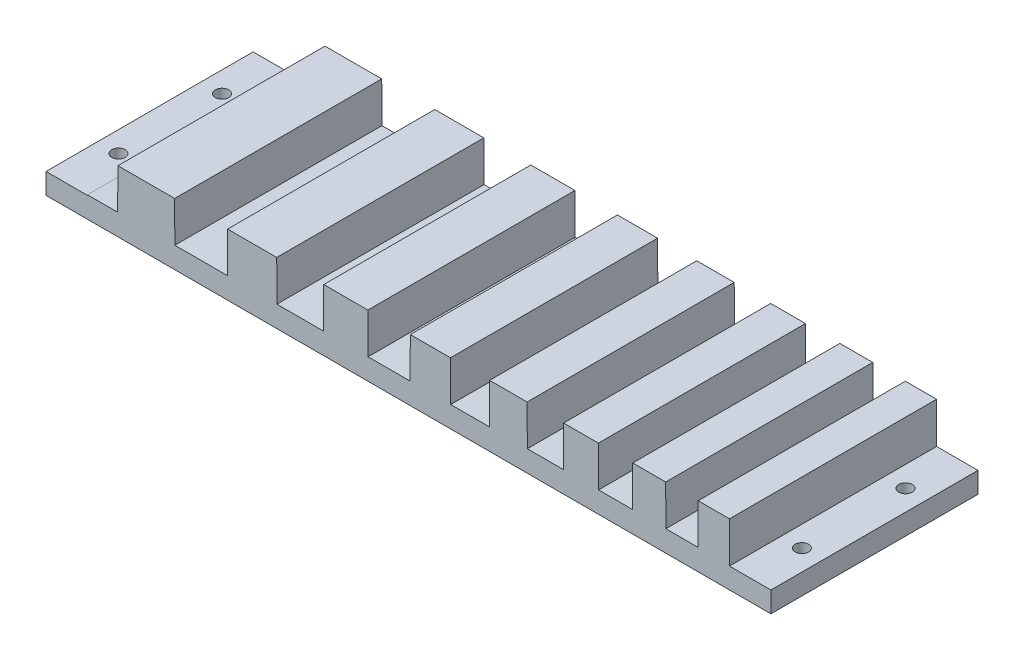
ISO-10303-21;
HEADER;
FILE_DESCRIPTION(('STEP AP214'),'2;1');
FILE_NAME('part.step','',(''),(''),'','','');
FILE_SCHEMA(('AUTOMOTIVE_DESIGN { 1 0 10303 214 1 1 1 1 }'));
ENDSEC;
DATA;
#1=APPLICATION_CONTEXT('core data for automotive mechanical design processes');
#2=APPLICATION_PROTOCOL_DEFINITION('international standard','automotive_design',2000,#1);
#3=PRODUCT_CONTEXT('',#1,'mechanical');
#4=PRODUCT('Part','Part','',(#3));
#5=PRODUCT_RELATED_PRODUCT_CATEGORY('part','',(#4));
#6=PRODUCT_DEFINITION_FORMATION('','',#4);
#7=PRODUCT_DEFINITION_CONTEXT('part definition',#1,'design');
#8=PRODUCT_DEFINITION('design','',#6,#7);
#9=PRODUCT_DEFINITION_SHAPE('','',#8);
#10=(LENGTH_UNIT() NAMED_UNIT(*) SI_UNIT(.MILLI.,.METRE.));
#11=(NAMED_UNIT(*) PLANE_ANGLE_UNIT() SI_UNIT($,.RADIAN.));
#12=(NAMED_UNIT(*) SI_UNIT($,.STERADIAN.) SOLID_ANGLE_UNIT());
#13=UNCERTAINTY_MEASURE_WITH_UNIT(LENGTH_MEASURE(1.E-05),#10,'distance_accuracy_value','');
#14=(GEOMETRIC_REPRESENTATION_CONTEXT(3) GLOBAL_UNCERTAINTY_ASSIGNED_CONTEXT((#13)) GLOBAL_UNIT_ASSIGNED_CONTEXT((#10,
#11,#12)) REPRESENTATION_CONTEXT('',''));
#15=CARTESIAN_POINT('',(0.,0.,0.));
#16=DIRECTION('',(0.,0.,1.));
#17=DIRECTION('',(1.,0.,0.));
#18=AXIS2_PLACEMENT_3D('',#15,#16,#17);
#19=CARTESIAN_POINT('',(0.,0.244013,100.));
#20=DIRECTION('',(0.,-1.,0.));
#21=DIRECTION('',(0.,0.,-1.));
#22=AXIS2_PLACEMENT_3D('',#19,#20,#21);
#23=PLANE('',#22);
#24=DIRECTION('',(-1.,0.,0.));
#25=VECTOR('',#24,1.);
#26=CARTESIAN_POINT('',(0.,0.244013,0.));
#27=LINE('',#26,#25);
#28=CARTESIAN_POINT('',(14.599987,0.244013,0.));
#29=VERTEX_POINT('',#28);
#30=CARTESIAN_POINT('',(0.,0.244013,0.));
#31=VERTEX_POINT('',#30);
#32=EDGE_CURVE('E311',#29,#31,#27,.T.);
#33=ORIENTED_EDGE('',*,*,#32,.T.);
#34=DIRECTION('',(0.,0.,-1.));
#35=VECTOR('',#34,1.);
#36=CARTESIAN_POINT('',(0.,0.244013,100.));
#37=LINE('',#36,#35);
#38=CARTESIAN_POINT('',(0.,0.244013,100.));
#39=VERTEX_POINT('',#38);
#40=EDGE_CURVE('E11',#39,#31,#37,.T.);
#41=ORIENTED_EDGE('',*,*,#40,.F.);
#42=DIRECTION('',(-1.,0.,0.));
#43=VECTOR('',#42,1.);
#44=CARTESIAN_POINT('',(0.,0.244013,100.));
#45=LINE('',#44,#43);
#46=CARTESIAN_POINT('',(14.599987,0.244013,100.));
#47=VERTEX_POINT('',#46);
#48=EDGE_CURVE('E386',#47,#39,#45,.T.);
#49=ORIENTED_EDGE('',*,*,#48,.F.);
#50=DIRECTION('',(0.,0.,-1.));
#51=VECTOR('',#50,1.);
#52=CARTESIAN_POINT('',(14.599987,0.244013,100.));
#53=LINE('',#52,#51);
#54=EDGE_CURVE('E307',#47,#29,#53,.T.);
#55=ORIENTED_EDGE('',*,*,#54,.T.);
#56=EDGE_LOOP('',(#33,#41,#49,#55));
#57=FACE_BOUND('',#56,.T.);
#58=ADVANCED_FACE('F33',(#57),#23,.F.);
#59=CARTESIAN_POINT('',(0.,0.244013,100.));
#60=DIRECTION('',(1.,0.,0.));
#61=DIRECTION('',(0.,0.,-1.));
#62=AXIS2_PLACEMENT_3D('',#59,#60,#61);
#63=PLANE('',#62);
#64=DIRECTION('',(0.,-1.,0.));
#65=VECTOR('',#64,1.);
#66=CARTESIAN_POINT('',(0.,0.244013,0.));
#67=LINE('',#66,#65);
#68=CARTESIAN_POINT('',(0.,0.,0.));
#69=VERTEX_POINT('',#68);
#70=EDGE_CURVE('E314',#31,#69,#67,.T.);
#71=ORIENTED_EDGE('',*,*,#70,.T.);
#72=DIRECTION('',(0.,0.,-1.));
#73=VECTOR('',#72,1.);
#74=CARTESIAN_POINT('',(0.,0.,100.));
#75=LINE('',#74,#73);
#76=CARTESIAN_POINT('',(0.,0.,100.));
#77=VERTEX_POINT('',#76);
#78=EDGE_CURVE('E42',#77,#69,#75,.T.);
#79=ORIENTED_EDGE('',*,*,#78,.F.);
#80=DIRECTION('',(0.,-1.,0.));
#81=VECTOR('',#80,1.);
#82=CARTESIAN_POINT('',(0.,0.244013,100.));
#83=LINE('',#82,#81);
#84=EDGE_CURVE('E184',#39,#77,#83,.T.);
#85=ORIENTED_EDGE('',*,*,#84,.F.);
#86=ORIENTED_EDGE('',*,*,#40,.T.);
#87=EDGE_LOOP('',(#71,#79,#85,#86));
#88=FACE_BOUND('',#87,.T.);
#89=ADVANCED_FACE('F603',(#88),#63,.F.);
#90=CARTESIAN_POINT('',(0.,0.,100.));
#91=DIRECTION('',(0.,-1.,0.));
#92=DIRECTION('',(1.,0.,0.));
#93=AXIS2_PLACEMENT_3D('',#90,#91,#92);
#94=PLANE('',#93);
#95=CARTESIAN_POINT('',(-10.,0.,25.));
#96=DIRECTION('',(0.,-1.,0.));
#97=DIRECTION('',(1.,0.,0.));
#98=AXIS2_PLACEMENT_3D('',#95,#96,#97);
#99=CIRCLE('',#98,3.25);
#100=CARTESIAN_POINT('',(-6.75000000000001,0.,25.));
#101=VERTEX_POINT('',#100);
#102=EDGE_CURVE('E315',#101,#101,#99,.T.);
#103=ORIENTED_EDGE('',*,*,#102,.T.);
#104=EDGE_LOOP('',(#103));
#105=FACE_BOUND('',#104,.T.);
#106=CARTESIAN_POINT('',(-10.,0.,75.));
#107=DIRECTION('',(0.,-1.,0.));
#108=DIRECTION('',(1.,0.,0.));
#109=AXIS2_PLACEMENT_3D('',#106,#107,#108);
#110=CIRCLE('',#109,3.25);
#111=CARTESIAN_POINT('',(-6.75000000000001,0.,75.));
#112=VERTEX_POINT('',#111);
#113=EDGE_CURVE('E497',#112,#112,#110,.T.);
#114=ORIENTED_EDGE('',*,*,#113,.T.);
#115=EDGE_LOOP('',(#114));
#116=FACE_BOUND('',#115,.T.);
#117=DIRECTION('',(-1.,0.,0.));
#118=VECTOR('',#117,1.);
#119=CARTESIAN_POINT('',(0.,0.,0.));
#120=LINE('',#119,#118);
#121=CARTESIAN_POINT('',(-20.,0.,0.));
#122=VERTEX_POINT('',#121);
#123=EDGE_CURVE('E317',#69,#122,#120,.T.);
#124=ORIENTED_EDGE('',*,*,#123,.T.);
#125=DIRECTION('',(0.,0.,-1.));
#126=VECTOR('',#125,1.);
#127=CARTESIAN_POINT('',(-20.,0.,100.));
#128=LINE('',#127,#126);
#129=CARTESIAN_POINT('',(-20.,0.,100.));
#130=VERTEX_POINT('',#129);
#131=EDGE_CURVE('E483',#130,#122,#128,.T.);
#132=ORIENTED_EDGE('',*,*,#131,.F.);
#133=DIRECTION('',(-1.,0.,0.));
#134=VECTOR('',#133,1.);
#135=CARTESIAN_POINT('',(0.,0.,100.));
#136=LINE('',#135,#134);
#137=EDGE_CURVE('E512',#77,#130,#136,.T.);
#138=ORIENTED_EDGE('',*,*,#137,.F.);
#139=ORIENTED_EDGE('',*,*,#78,.T.);
#140=EDGE_LOOP('',(#124,#132,#138,#139));
#141=FACE_BOUND('',#140,.T.);
#142=ADVANCED_FACE('F607',(#105,#116,#141),#94,.F.);
#143=CARTESIAN_POINT('',(-20.,0.,100.));
#144=DIRECTION('',(1.,0.,0.));
#145=DIRECTION('',(0.,0.,-1.));
#146=AXIS2_PLACEMENT_3D('',#143,#144,#145);
#147=PLANE('',#146);
#148=DIRECTION('',(0.,-1.,0.));
#149=VECTOR('',#148,1.);
#150=CARTESIAN_POINT('',(-20.,0.,0.));
#151=LINE('',#150,#149);
#152=CARTESIAN_POINT('',(-20.,-10.,0.));
#153=VERTEX_POINT('',#152);
#154=EDGE_CURVE('E319',#122,#153,#151,.T.);
#155=ORIENTED_EDGE('',*,*,#154,.T.);
#156=DIRECTION('',(0.,0.,-1.));
#157=VECTOR('',#156,1.);
#158=CARTESIAN_POINT('',(-20.,-10.,100.));
#159=LINE('',#158,#157);
#160=CARTESIAN_POINT('',(-20.,-10.,100.));
#161=VERTEX_POINT('',#160);
#162=EDGE_CURVE('E480',#161,#153,#159,.T.);
#163=ORIENTED_EDGE('',*,*,#162,.F.);
#164=DIRECTION('',(0.,-1.,0.));
#165=VECTOR('',#164,1.);
#166=CARTESIAN_POINT('',(-20.,0.,100.));
#167=LINE('',#166,#165);
#168=EDGE_CURVE('E514',#130,#161,#167,.T.);
#169=ORIENTED_EDGE('',*,*,#168,.F.);
#170=ORIENTED_EDGE('',*,*,#131,.T.);
#171=EDGE_LOOP('',(#155,#163,#169,#170));
#172=FACE_BOUND('',#171,.T.);
#173=ADVANCED_FACE('F611',(#172),#147,.F.);
#174=CARTESIAN_POINT('',(-20.,-10.,100.));
#175=DIRECTION('',(0.,1.,0.));
#176=DIRECTION('',(0.,0.,1.));
#177=AXIS2_PLACEMENT_3D('',#174,#175,#176);
#178=PLANE('',#177);
#179=CARTESIAN_POINT('',(320.,-10.,75.));
#180=DIRECTION('',(0.,1.,0.));
#181=DIRECTION('',(0.,0.,1.));
#182=AXIS2_PLACEMENT_3D('',#179,#180,#181);
#183=CIRCLE('',#182,3.25000000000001);
#184=CARTESIAN_POINT('',(320.,-10.,78.25));
#185=VERTEX_POINT('',#184);
#186=EDGE_CURVE('E494',#185,#185,#183,.T.);
#187=ORIENTED_EDGE('',*,*,#186,.T.);
#188=EDGE_LOOP('',(#187));
#189=FACE_BOUND('',#188,.T.);
#190=CARTESIAN_POINT('',(320.,-10.,25.));
#191=DIRECTION('',(0.,1.,0.));
#192=DIRECTION('',(0.,0.,1.));
#193=AXIS2_PLACEMENT_3D('',#190,#191,#192);
#194=CIRCLE('',#193,3.25000000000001);
#195=CARTESIAN_POINT('',(320.,-10.,28.25));
#196=VERTEX_POINT('',#195);
#197=EDGE_CURVE('E491',#196,#196,#194,.T.);
#198=ORIENTED_EDGE('',*,*,#197,.T.);
#199=EDGE_LOOP('',(#198));
#200=FACE_BOUND('',#199,.T.);
#201=CARTESIAN_POINT('',(-10.,-10.,25.));
#202=DIRECTION('',(0.,1.,0.));
#203=DIRECTION('',(0.,0.,1.));
#204=AXIS2_PLACEMENT_3D('',#201,#202,#203);
#205=CIRCLE('',#204,3.25);
#206=CARTESIAN_POINT('',(-10.,-10.,28.25));
#207=VERTEX_POINT('',#206);
#208=EDGE_CURVE('E36',#207,#207,#205,.T.);
#209=ORIENTED_EDGE('',*,*,#208,.T.);
#210=EDGE_LOOP('',(#209));
#211=FACE_BOUND('',#210,.T.);
#212=CARTESIAN_POINT('',(-10.,-10.,75.));
#213=DIRECTION('',(0.,1.,0.));
#214=DIRECTION('',(0.,0.,1.));
#215=AXIS2_PLACEMENT_3D('',#212,#213,#214);
#216=CIRCLE('',#215,3.25);
#217=CARTESIAN_POINT('',(-10.,-10.,78.25));
#218=VERTEX_POINT('',#217);
#219=EDGE_CURVE('E495',#218,#218,#216,.T.);
#220=ORIENTED_EDGE('',*,*,#219,.T.);
#221=EDGE_LOOP('',(#220));
#222=FACE_BOUND('',#221,.T.);
#223=DIRECTION('',(1.,0.,0.));
#224=VECTOR('',#223,1.);
#225=CARTESIAN_POINT('',(-20.,-10.,0.));
#226=LINE('',#225,#224);
#227=CARTESIAN_POINT('',(330.,-10.,0.));
#228=VERTEX_POINT('',#227);
#229=EDGE_CURVE('E321',#153,#228,#226,.T.);
#230=ORIENTED_EDGE('',*,*,#229,.T.);
#231=DIRECTION('',(0.,0.,-1.));
#232=VECTOR('',#231,1.);
#233=CARTESIAN_POINT('',(330.,-10.,100.));
#234=LINE('',#233,#232);
#235=CARTESIAN_POINT('',(330.,-10.,100.));
#236=VERTEX_POINT('',#235);
#237=EDGE_CURVE('E477',#236,#228,#234,.T.);
#238=ORIENTED_EDGE('',*,*,#237,.F.);
#239=DIRECTION('',(1.,0.,0.));
#240=VECTOR('',#239,1.);
#241=CARTESIAN_POINT('',(-20.,-10.,100.));
#242=LINE('',#241,#240);
#243=EDGE_CURVE('E516',#161,#236,#242,.T.);
#244=ORIENTED_EDGE('',*,*,#243,.F.);
#245=ORIENTED_EDGE('',*,*,#162,.T.);
#246=EDGE_LOOP('',(#230,#238,#244,#245));
#247=FACE_BOUND('',#246,.T.);
#248=ADVANCED_FACE('F617',(#189,#200,#211,#222,#247),#178,.F.);
#249=CARTESIAN_POINT('',(330.,0.,100.));
#250=DIRECTION('',(-1.,0.,0.));
#251=DIRECTION('',(0.,0.,1.));
#252=AXIS2_PLACEMENT_3D('',#249,#250,#251);
#253=PLANE('',#252);
#254=DIRECTION('',(0.,1.,0.));
#255=VECTOR('',#254,1.);
#256=CARTESIAN_POINT('',(330.,0.,0.));
#257=LINE('',#256,#255);
#258=CARTESIAN_POINT('',(330.,0.,0.));
#259=VERTEX_POINT('',#258);
#260=EDGE_CURVE('E323',#228,#259,#257,.T.);
#261=ORIENTED_EDGE('',*,*,#260,.T.);
#262=DIRECTION('',(0.,0.,-1.));
#263=VECTOR('',#262,1.);
#264=CARTESIAN_POINT('',(330.,0.,100.));
#265=LINE('',#264,#263);
#266=CARTESIAN_POINT('',(330.,0.,100.));
#267=VERTEX_POINT('',#266);
#268=EDGE_CURVE('E474',#267,#259,#265,.T.);
#269=ORIENTED_EDGE('',*,*,#268,.F.);
#270=DIRECTION('',(0.,1.,0.));
#271=VECTOR('',#270,1.);
#272=CARTESIAN_POINT('',(330.,0.,100.));
#273=LINE('',#272,#271);
#274=EDGE_CURVE('E518',#236,#267,#273,.T.);
#275=ORIENTED_EDGE('',*,*,#274,.F.);
#276=ORIENTED_EDGE('',*,*,#237,.T.);
#277=EDGE_LOOP('',(#261,#269,#275,#276));
#278=FACE_BOUND('',#277,.T.);
#279=ADVANCED_FACE('F621',(#278),#253,.F.);
#280=CARTESIAN_POINT('',(310.000009,0.,100.));
#281=DIRECTION('',(0.,-1.,0.));
#282=DIRECTION('',(1.,0.,0.));
#283=AXIS2_PLACEMENT_3D('',#280,#281,#282);
#284=PLANE('',#283);
#285=CARTESIAN_POINT('',(320.,0.,75.));
#286=DIRECTION('',(0.,-1.,0.));
#287=DIRECTION('',(1.,0.,0.));
#288=AXIS2_PLACEMENT_3D('',#285,#286,#287);
#289=CIRCLE('',#288,3.25000000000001);
#290=CARTESIAN_POINT('',(323.25,0.,75.));
#291=VERTEX_POINT('',#290);
#292=EDGE_CURVE('E492',#291,#291,#289,.T.);
#293=ORIENTED_EDGE('',*,*,#292,.T.);
#294=EDGE_LOOP('',(#293));
#295=FACE_BOUND('',#294,.T.);
#296=CARTESIAN_POINT('',(320.,0.,25.));
#297=DIRECTION('',(0.,-1.,0.));
#298=DIRECTION('',(1.,0.,0.));
#299=AXIS2_PLACEMENT_3D('',#296,#297,#298);
#300=CIRCLE('',#299,3.25000000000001);
#301=CARTESIAN_POINT('',(323.25,0.,25.));
#302=VERTEX_POINT('',#301);
#303=EDGE_CURVE('E488',#302,#302,#300,.T.);
#304=ORIENTED_EDGE('',*,*,#303,.T.);
#305=EDGE_LOOP('',(#304));
#306=FACE_BOUND('',#305,.T.);
#307=DIRECTION('',(-1.,0.,0.));
#308=VECTOR('',#307,1.);
#309=CARTESIAN_POINT('',(310.000009,0.,0.));
#310=LINE('',#309,#308);
#311=CARTESIAN_POINT('',(310.000009,0.,0.));
#312=VERTEX_POINT('',#311);
#313=EDGE_CURVE('E325',#259,#312,#310,.T.);
#314=ORIENTED_EDGE('',*,*,#313,.T.);
#315=DIRECTION('',(0.,0.,-1.));
#316=VECTOR('',#315,1.);
#317=CARTESIAN_POINT('',(310.000009,0.,100.));
#318=LINE('',#317,#316);
#319=CARTESIAN_POINT('',(310.000009,0.,100.));
#320=VERTEX_POINT('',#319);
#321=EDGE_CURVE('E471',#320,#312,#318,.T.);
#322=ORIENTED_EDGE('',*,*,#321,.F.);
#323=DIRECTION('',(-1.,0.,0.));
#324=VECTOR('',#323,1.);
#325=CARTESIAN_POINT('',(310.000009,0.,100.));
#326=LINE('',#325,#324);
#327=EDGE_CURVE('E520',#267,#320,#326,.T.);
#328=ORIENTED_EDGE('',*,*,#327,.F.);
#329=ORIENTED_EDGE('',*,*,#268,.T.);
#330=EDGE_LOOP('',(#314,#322,#328,#329));
#331=FACE_BOUND('',#330,.T.);
#332=ADVANCED_FACE('F624',(#295,#306,#331),#284,.F.);
#333=CARTESIAN_POINT('',(310.000009,19.749843,100.));
#334=DIRECTION('',(-1.,0.,0.));
#335=DIRECTION('',(0.,0.,1.));
#336=AXIS2_PLACEMENT_3D('',#333,#334,#335);
#337=PLANE('',#336);
#338=DIRECTION('',(0.,1.,0.));
#339=VECTOR('',#338,1.);
#340=CARTESIAN_POINT('',(310.000009,19.749843,0.));
#341=LINE('',#340,#339);
#342=CARTESIAN_POINT('',(310.000009,19.749843,0.));
#343=VERTEX_POINT('',#342);
#344=EDGE_CURVE('E327',#312,#343,#341,.T.);
#345=ORIENTED_EDGE('',*,*,#344,.T.);
#346=DIRECTION('',(0.,0.,-1.));
#347=VECTOR('',#346,1.);
#348=CARTESIAN_POINT('',(310.000009,19.749843,100.));
#349=LINE('',#348,#347);
#350=CARTESIAN_POINT('',(310.000009,19.749843,100.));
#351=VERTEX_POINT('',#350);
#352=EDGE_CURVE('E468',#351,#343,#349,.T.);
#353=ORIENTED_EDGE('',*,*,#352,.F.);
#354=DIRECTION('',(0.,1.,0.));
#355=VECTOR('',#354,1.);
#356=CARTESIAN_POINT('',(310.000009,19.749843,100.));
#357=LINE('',#356,#355);
#358=EDGE_CURVE('E522',#320,#351,#357,.T.);
#359=ORIENTED_EDGE('',*,*,#358,.F.);
#360=ORIENTED_EDGE('',*,*,#321,.T.);
#361=EDGE_LOOP('',(#345,#353,#359,#360));
#362=FACE_BOUND('',#361,.T.);
#363=ADVANCED_FACE('F628',(#362),#337,.F.);
#364=CARTESIAN_POINT('',(294.900006,19.749843,100.));
#365=DIRECTION('',(0.,-1.,0.));
#366=DIRECTION('',(0.,0.,-1.));
#367=AXIS2_PLACEMENT_3D('',#364,#365,#366);
#368=PLANE('',#367);
#369=DIRECTION('',(-1.,0.,0.));
#370=VECTOR('',#369,1.);
#371=CARTESIAN_POINT('',(294.900006,19.749843,0.));
#372=LINE('',#371,#370);
#373=CARTESIAN_POINT('',(294.900006,19.749843,0.));
#374=VERTEX_POINT('',#373);
#375=EDGE_CURVE('E329',#343,#374,#372,.T.);
#376=ORIENTED_EDGE('',*,*,#375,.T.);
#377=DIRECTION('',(0.,0.,-1.));
#378=VECTOR('',#377,1.);
#379=CARTESIAN_POINT('',(294.900006,19.749843,100.));
#380=LINE('',#379,#378);
#381=CARTESIAN_POINT('',(294.900006,19.749843,100.));
#382=VERTEX_POINT('',#381);
#383=EDGE_CURVE('E465',#382,#374,#380,.T.);
#384=ORIENTED_EDGE('',*,*,#383,.F.);
#385=DIRECTION('',(-1.,0.,0.));
#386=VECTOR('',#385,1.);
#387=CARTESIAN_POINT('',(294.900006,19.749843,100.));
#388=LINE('',#387,#386);
#389=EDGE_CURVE('E524',#351,#382,#388,.T.);
#390=ORIENTED_EDGE('',*,*,#389,.F.);
#391=ORIENTED_EDGE('',*,*,#352,.T.);
#392=EDGE_LOOP('',(#376,#384,#390,#391));
#393=FACE_BOUND('',#392,.T.);
#394=ADVANCED_FACE('F632',(#393),#368,.F.);
#395=CARTESIAN_POINT('',(294.799988,0.244013,100.));
#396=DIRECTION('',(0.999986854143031,-0.00512752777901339,0.));
#397=DIRECTION('',(0.00512752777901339,0.999986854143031,0.));
#398=AXIS2_PLACEMENT_3D('',#395,#396,#397);
#399=PLANE('',#398);
#400=DIRECTION('',(-0.00512752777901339,-0.999986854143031,0.));
#401=VECTOR('',#400,1.);
#402=CARTESIAN_POINT('',(294.799988,0.244013,0.));
#403=LINE('',#402,#401);
#404=CARTESIAN_POINT('',(294.799988,0.244013,0.));
#405=VERTEX_POINT('',#404);
#406=EDGE_CURVE('E331',#374,#405,#403,.T.);
#407=ORIENTED_EDGE('',*,*,#406,.T.);
#408=DIRECTION('',(0.,0.,-1.));
#409=VECTOR('',#408,1.);
#410=CARTESIAN_POINT('',(294.799988,0.244013,100.));
#411=LINE('',#410,#409);
#412=CARTESIAN_POINT('',(294.799988,0.244013,100.));
#413=VERTEX_POINT('',#412);
#414=EDGE_CURVE('E462',#413,#405,#411,.T.);
#415=ORIENTED_EDGE('',*,*,#414,.F.);
#416=DIRECTION('',(-0.00512752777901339,-0.999986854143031,0.));
#417=VECTOR('',#416,1.);
#418=CARTESIAN_POINT('',(294.799988,0.244013,100.));
#419=LINE('',#418,#417);
#420=EDGE_CURVE('E526',#382,#413,#419,.T.);
#421=ORIENTED_EDGE('',*,*,#420,.F.);
#422=ORIENTED_EDGE('',*,*,#383,.T.);
#423=EDGE_LOOP('',(#407,#415,#421,#422));
#424=FACE_BOUND('',#423,.T.);
#425=ADVANCED_FACE('F636',(#424),#399,.F.);
#426=CARTESIAN_POINT('',(279.299988,0.244013,100.));
#427=DIRECTION('',(0.,-1.,0.));
#428=DIRECTION('',(0.,0.,-1.));
#429=AXIS2_PLACEMENT_3D('',#426,#427,#428);
#430=PLANE('',#429);
#431=DIRECTION('',(-1.,0.,0.));
#432=VECTOR('',#431,1.);
#433=CARTESIAN_POINT('',(279.299988,0.244013,0.));
#434=LINE('',#433,#432);
#435=CARTESIAN_POINT('',(279.299988,0.244013,0.));
#436=VERTEX_POINT('',#435);
#437=EDGE_CURVE('E333',#405,#436,#434,.T.);
#438=ORIENTED_EDGE('',*,*,#437,.T.);
#439=DIRECTION('',(0.,0.,-1.));
#440=VECTOR('',#439,1.);
#441=CARTESIAN_POINT('',(279.299988,0.244013,100.));
#442=LINE('',#441,#440);
#443=CARTESIAN_POINT('',(279.299988,0.244013,100.));
#444=VERTEX_POINT('',#443);
#445=EDGE_CURVE('E459',#444,#436,#442,.T.);
#446=ORIENTED_EDGE('',*,*,#445,.F.);
#447=DIRECTION('',(-1.,0.,0.));
#448=VECTOR('',#447,1.);
#449=CARTESIAN_POINT('',(279.299988,0.244013,100.));
#450=LINE('',#449,#448);
#451=EDGE_CURVE('E528',#413,#444,#450,.T.);
#452=ORIENTED_EDGE('',*,*,#451,.F.);
#453=ORIENTED_EDGE('',*,*,#414,.T.);
#454=EDGE_LOOP('',(#438,#446,#452,#453));
#455=FACE_BOUND('',#454,.T.);
#456=ADVANCED_FACE('F640',(#455),#430,.F.);
#457=CARTESIAN_POINT('',(279.200007,19.749843,100.));
#458=DIRECTION('',(-0.999986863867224,-0.00512563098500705,0.));
#459=DIRECTION('',(0.00512563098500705,-0.999986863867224,0.));
#460=AXIS2_PLACEMENT_3D('',#457,#458,#459);
#461=PLANE('',#460);
#462=DIRECTION('',(-0.00512563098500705,0.999986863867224,0.));
#463=VECTOR('',#462,1.);
#464=CARTESIAN_POINT('',(279.200007,19.749843,0.));
#465=LINE('',#464,#463);
#466=CARTESIAN_POINT('',(279.200007,19.749843,0.));
#467=VERTEX_POINT('',#466);
#468=EDGE_CURVE('E335',#436,#467,#465,.T.);
#469=ORIENTED_EDGE('',*,*,#468,.T.);
#470=DIRECTION('',(0.,0.,-1.));
#471=VECTOR('',#470,1.);
#472=CARTESIAN_POINT('',(279.200007,19.749843,100.));
#473=LINE('',#472,#471);
#474=CARTESIAN_POINT('',(279.200007,19.749843,100.));
#475=VERTEX_POINT('',#474);
#476=EDGE_CURVE('E456',#475,#467,#473,.T.);
#477=ORIENTED_EDGE('',*,*,#476,.F.);
#478=DIRECTION('',(-0.00512563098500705,0.999986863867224,0.));
#479=VECTOR('',#478,1.);
#480=CARTESIAN_POINT('',(279.200007,19.749843,100.));
#481=LINE('',#480,#479);
#482=EDGE_CURVE('E530',#444,#475,#481,.T.);
#483=ORIENTED_EDGE('',*,*,#482,.F.);
#484=ORIENTED_EDGE('',*,*,#445,.T.);
#485=EDGE_LOOP('',(#469,#477,#483,#484));
#486=FACE_BOUND('',#485,.T.);
#487=ADVANCED_FACE('F644',(#486),#461,.F.);
#488=CARTESIAN_POINT('',(263.300009,19.749843,100.));
#489=DIRECTION('',(0.,-1.,0.));
#490=DIRECTION('',(0.,0.,-1.));
#491=AXIS2_PLACEMENT_3D('',#488,#489,#490);
#492=PLANE('',#491);
#493=DIRECTION('',(-1.,0.,0.));
#494=VECTOR('',#493,1.);
#495=CARTESIAN_POINT('',(263.300009,19.749843,0.));
#496=LINE('',#495,#494);
#497=CARTESIAN_POINT('',(263.300009,19.749843,0.));
#498=VERTEX_POINT('',#497);
#499=EDGE_CURVE('E337',#467,#498,#496,.T.);
#500=ORIENTED_EDGE('',*,*,#499,.T.);
#501=DIRECTION('',(0.,0.,-1.));
#502=VECTOR('',#501,1.);
#503=CARTESIAN_POINT('',(263.300009,19.749843,100.));
#504=LINE('',#503,#502);
#505=CARTESIAN_POINT('',(263.300009,19.749843,100.));
#506=VERTEX_POINT('',#505);
#507=EDGE_CURVE('E453',#506,#498,#504,.T.);
#508=ORIENTED_EDGE('',*,*,#507,.F.);
#509=DIRECTION('',(-1.,0.,0.));
#510=VECTOR('',#509,1.);
#511=CARTESIAN_POINT('',(263.300009,19.749843,100.));
#512=LINE('',#511,#510);
#513=EDGE_CURVE('E532',#475,#506,#512,.T.);
#514=ORIENTED_EDGE('',*,*,#513,.F.);
#515=ORIENTED_EDGE('',*,*,#476,.T.);
#516=EDGE_LOOP('',(#500,#508,#514,#515));
#517=FACE_BOUND('',#516,.T.);
#518=ADVANCED_FACE('F648',(#517),#492,.F.);
#519=CARTESIAN_POINT('',(263.200028,0.244013,100.));
#520=DIRECTION('',(0.999986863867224,-0.0051256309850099,0.));
#521=DIRECTION('',(0.0051256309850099,0.999986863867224,0.));
#522=AXIS2_PLACEMENT_3D('',#519,#520,#521);
#523=PLANE('',#522);
#524=DIRECTION('',(-0.0051256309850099,-0.999986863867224,0.));
#525=VECTOR('',#524,1.);
#526=CARTESIAN_POINT('',(263.200028,0.244013,0.));
#527=LINE('',#526,#525);
#528=CARTESIAN_POINT('',(263.200028,0.244013,0.));
#529=VERTEX_POINT('',#528);
#530=EDGE_CURVE('E339',#498,#529,#527,.T.);
#531=ORIENTED_EDGE('',*,*,#530,.T.);
#532=DIRECTION('',(0.,0.,-1.));
#533=VECTOR('',#532,1.);
#534=CARTESIAN_POINT('',(263.200028,0.244013,100.));
#535=LINE('',#534,#533);
#536=CARTESIAN_POINT('',(263.200028,0.244013,100.));
#537=VERTEX_POINT('',#536);
#538=EDGE_CURVE('E450',#537,#529,#535,.T.);
#539=ORIENTED_EDGE('',*,*,#538,.F.);
#540=DIRECTION('',(-0.0051256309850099,-0.999986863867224,0.));
#541=VECTOR('',#540,1.);
#542=CARTESIAN_POINT('',(263.200028,0.244013,100.));
#543=LINE('',#542,#541);
#544=EDGE_CURVE('E534',#506,#537,#543,.T.);
#545=ORIENTED_EDGE('',*,*,#544,.F.);
#546=ORIENTED_EDGE('',*,*,#507,.T.);
#547=EDGE_LOOP('',(#531,#539,#545,#546));
#548=FACE_BOUND('',#547,.T.);
#549=ADVANCED_FACE('F652',(#548),#523,.F.);
#550=CARTESIAN_POINT('',(246.800014,0.244013,100.));
#551=DIRECTION('',(0.,-1.,0.));
#552=DIRECTION('',(0.,0.,-1.));
#553=AXIS2_PLACEMENT_3D('',#550,#551,#552);
#554=PLANE('',#553);
#555=DIRECTION('',(-1.,0.,0.));
#556=VECTOR('',#555,1.);
#557=CARTESIAN_POINT('',(246.800014,0.244013,0.));
#558=LINE('',#557,#556);
#559=CARTESIAN_POINT('',(246.800014,0.244013,0.));
#560=VERTEX_POINT('',#559);
#561=EDGE_CURVE('E341',#529,#560,#558,.T.);
#562=ORIENTED_EDGE('',*,*,#561,.T.);
#563=DIRECTION('',(0.,0.,-1.));
#564=VECTOR('',#563,1.);
#565=CARTESIAN_POINT('',(246.800014,0.244013,100.));
#566=LINE('',#565,#564);
#567=CARTESIAN_POINT('',(246.800014,0.244013,100.));
#568=VERTEX_POINT('',#567);
#569=EDGE_CURVE('E447',#568,#560,#566,.T.);
#570=ORIENTED_EDGE('',*,*,#569,.F.);
#571=DIRECTION('',(-1.,0.,0.));
#572=VECTOR('',#571,1.);
#573=CARTESIAN_POINT('',(246.800014,0.244013,100.));
#574=LINE('',#573,#572);
#575=EDGE_CURVE('E536',#537,#568,#574,.T.);
#576=ORIENTED_EDGE('',*,*,#575,.F.);
#577=ORIENTED_EDGE('',*,*,#538,.T.);
#578=EDGE_LOOP('',(#562,#570,#576,#577));
#579=FACE_BOUND('',#578,.T.);
#580=ADVANCED_FACE('F656',(#579),#554,.F.);
#581=CARTESIAN_POINT('',(246.699996,19.749843,100.));
#582=DIRECTION('',(-0.999986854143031,-0.00512752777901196,0.));
#583=DIRECTION('',(0.00512752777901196,-0.999986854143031,0.));
#584=AXIS2_PLACEMENT_3D('',#581,#582,#583);
#585=PLANE('',#584);
#586=DIRECTION('',(-0.00512752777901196,0.999986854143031,0.));
#587=VECTOR('',#586,1.);
#588=CARTESIAN_POINT('',(246.699996,19.749843,0.));
#589=LINE('',#588,#587);
#590=CARTESIAN_POINT('',(246.699996,19.749843,0.));
#591=VERTEX_POINT('',#590);
#592=EDGE_CURVE('E343',#560,#591,#589,.T.);
#593=ORIENTED_EDGE('',*,*,#592,.T.);
#594=DIRECTION('',(0.,0.,-1.));
#595=VECTOR('',#594,1.);
#596=CARTESIAN_POINT('',(246.699996,19.749843,100.));
#597=LINE('',#596,#595);
#598=CARTESIAN_POINT('',(246.699996,19.749843,100.));
#599=VERTEX_POINT('',#598);
#600=EDGE_CURVE('E444',#599,#591,#597,.T.);
#601=ORIENTED_EDGE('',*,*,#600,.F.);
#602=DIRECTION('',(-0.00512752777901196,0.999986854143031,0.));
#603=VECTOR('',#602,1.);
#604=CARTESIAN_POINT('',(246.699996,19.749843,100.));
#605=LINE('',#604,#603);
#606=EDGE_CURVE('E538',#568,#599,#605,.T.);
#607=ORIENTED_EDGE('',*,*,#606,.F.);
#608=ORIENTED_EDGE('',*,*,#569,.T.);
#609=EDGE_LOOP('',(#593,#601,#607,#608));
#610=FACE_BOUND('',#609,.T.);
#611=ADVANCED_FACE('F660',(#610),#585,.F.);
#612=CARTESIAN_POINT('',(229.900022,19.749843,100.));
#613=DIRECTION('',(0.,-1.,0.));
#614=DIRECTION('',(0.,0.,-1.));
#615=AXIS2_PLACEMENT_3D('',#612,#613,#614);
#616=PLANE('',#615);
#617=DIRECTION('',(-1.,0.,0.));
#618=VECTOR('',#617,1.);
#619=CARTESIAN_POINT('',(229.900022,19.749843,0.));
#620=LINE('',#619,#618);
#621=CARTESIAN_POINT('',(229.900022,19.749843,0.));
#622=VERTEX_POINT('',#621);
#623=EDGE_CURVE('E345',#591,#622,#620,.T.);
#624=ORIENTED_EDGE('',*,*,#623,.T.);
#625=DIRECTION('',(0.,0.,-1.));
#626=VECTOR('',#625,1.);
#627=CARTESIAN_POINT('',(229.900022,19.749843,100.));
#628=LINE('',#627,#626);
#629=CARTESIAN_POINT('',(229.900022,19.749843,100.));
#630=VERTEX_POINT('',#629);
#631=EDGE_CURVE('E441',#630,#622,#628,.T.);
#632=ORIENTED_EDGE('',*,*,#631,.F.);
#633=DIRECTION('',(-1.,0.,0.));
#634=VECTOR('',#633,1.);
#635=CARTESIAN_POINT('',(229.900022,19.749843,100.));
#636=LINE('',#635,#634);
#637=EDGE_CURVE('E540',#599,#630,#636,.T.);
#638=ORIENTED_EDGE('',*,*,#637,.F.);
#639=ORIENTED_EDGE('',*,*,#600,.T.);
#640=EDGE_LOOP('',(#624,#632,#638,#639));
#641=FACE_BOUND('',#640,.T.);
#642=ADVANCED_FACE('F664',(#641),#616,.F.);
#643=CARTESIAN_POINT('',(229.800004,0.244013,100.));
#644=DIRECTION('',(0.999986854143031,-0.00512752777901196,0.));
#645=DIRECTION('',(0.00512752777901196,0.999986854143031,0.));
#646=AXIS2_PLACEMENT_3D('',#643,#644,#645);
#647=PLANE('',#646);
#648=DIRECTION('',(-0.00512752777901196,-0.999986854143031,0.));
#649=VECTOR('',#648,1.);
#650=CARTESIAN_POINT('',(229.800004,0.244013,0.));
#651=LINE('',#650,#649);
#652=CARTESIAN_POINT('',(229.800004,0.244013,0.));
#653=VERTEX_POINT('',#652);
#654=EDGE_CURVE('E347',#622,#653,#651,.T.);
#655=ORIENTED_EDGE('',*,*,#654,.T.);
#656=DIRECTION('',(0.,0.,-1.));
#657=VECTOR('',#656,1.);
#658=CARTESIAN_POINT('',(229.800004,0.244013,100.));
#659=LINE('',#658,#657);
#660=CARTESIAN_POINT('',(229.800004,0.244013,100.));
#661=VERTEX_POINT('',#660);
#662=EDGE_CURVE('E438',#661,#653,#659,.T.);
#663=ORIENTED_EDGE('',*,*,#662,.F.);
#664=DIRECTION('',(-0.00512752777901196,-0.999986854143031,0.));
#665=VECTOR('',#664,1.);
#666=CARTESIAN_POINT('',(229.800004,0.244013,100.));
#667=LINE('',#666,#665);
#668=EDGE_CURVE('E542',#630,#661,#667,.T.);
#669=ORIENTED_EDGE('',*,*,#668,.F.);
#670=ORIENTED_EDGE('',*,*,#631,.T.);
#671=EDGE_LOOP('',(#655,#663,#669,#670));
#672=FACE_BOUND('',#671,.T.);
#673=ADVANCED_FACE('F668',(#672),#647,.F.);
#674=CARTESIAN_POINT('',(212.399996,0.244013,100.));
#675=DIRECTION('',(0.,-1.,0.));
#676=DIRECTION('',(0.,0.,-1.));
#677=AXIS2_PLACEMENT_3D('',#674,#675,#676);
#678=PLANE('',#677);
#679=DIRECTION('',(-1.,0.,0.));
#680=VECTOR('',#679,1.);
#681=CARTESIAN_POINT('',(212.399996,0.244013,0.));
#682=LINE('',#681,#680);
#683=CARTESIAN_POINT('',(212.399996,0.244013,0.));
#684=VERTEX_POINT('',#683);
#685=EDGE_CURVE('E349',#653,#684,#682,.T.);
#686=ORIENTED_EDGE('',*,*,#685,.T.);
#687=DIRECTION('',(0.,0.,-1.));
#688=VECTOR('',#687,1.);
#689=CARTESIAN_POINT('',(212.399996,0.244013,100.));
#690=LINE('',#689,#688);
#691=CARTESIAN_POINT('',(212.399996,0.244013,100.));
#692=VERTEX_POINT('',#691);
#693=EDGE_CURVE('E435',#692,#684,#690,.T.);
#694=ORIENTED_EDGE('',*,*,#693,.F.);
#695=DIRECTION('',(-1.,0.,0.));
#696=VECTOR('',#695,1.);
#697=CARTESIAN_POINT('',(212.399996,0.244013,100.));
#698=LINE('',#697,#696);
#699=EDGE_CURVE('E544',#661,#692,#698,.T.);
#700=ORIENTED_EDGE('',*,*,#699,.F.);
#701=ORIENTED_EDGE('',*,*,#662,.T.);
#702=EDGE_LOOP('',(#686,#694,#700,#701));
#703=FACE_BOUND('',#702,.T.);
#704=ADVANCED_FACE('F672',(#703),#678,.F.);
#705=CARTESIAN_POINT('',(212.300016,19.749843,100.));
#706=DIRECTION('',(-0.99998686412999,-0.00512557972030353,0.));
#707=DIRECTION('',(0.00512557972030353,-0.99998686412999,0.));
#708=AXIS2_PLACEMENT_3D('',#705,#706,#707);
#709=PLANE('',#708);
#710=DIRECTION('',(-0.00512557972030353,0.99998686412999,0.));
#711=VECTOR('',#710,1.);
#712=CARTESIAN_POINT('',(212.300016,19.749843,0.));
#713=LINE('',#712,#711);
#714=CARTESIAN_POINT('',(212.300016,19.749843,0.));
#715=VERTEX_POINT('',#714);
#716=EDGE_CURVE('E351',#684,#715,#713,.T.);
#717=ORIENTED_EDGE('',*,*,#716,.T.);
#718=DIRECTION('',(0.,0.,-1.));
#719=VECTOR('',#718,1.);
#720=CARTESIAN_POINT('',(212.300016,19.749843,100.));
#721=LINE('',#720,#719);
#722=CARTESIAN_POINT('',(212.300016,19.749843,100.));
#723=VERTEX_POINT('',#722);
#724=EDGE_CURVE('E432',#723,#715,#721,.T.);
#725=ORIENTED_EDGE('',*,*,#724,.F.);
#726=DIRECTION('',(-0.00512557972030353,0.99998686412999,0.));
#727=VECTOR('',#726,1.);
#728=CARTESIAN_POINT('',(212.300016,19.749843,100.));
#729=LINE('',#728,#727);
#730=EDGE_CURVE('E546',#692,#723,#729,.T.);
#731=ORIENTED_EDGE('',*,*,#730,.F.);
#732=ORIENTED_EDGE('',*,*,#693,.T.);
#733=EDGE_LOOP('',(#717,#725,#731,#732));
#734=FACE_BOUND('',#733,.T.);
#735=ADVANCED_FACE('F676',(#734),#709,.F.);
#736=CARTESIAN_POINT('',(194.199994,19.749843,100.));
#737=DIRECTION('',(0.,-1.,0.));
#738=DIRECTION('',(0.,0.,-1.));
#739=AXIS2_PLACEMENT_3D('',#736,#737,#738);
#740=PLANE('',#739);
#741=DIRECTION('',(-1.,0.,0.));
#742=VECTOR('',#741,1.);
#743=CARTESIAN_POINT('',(194.199994,19.749843,0.));
#744=LINE('',#743,#742);
#745=CARTESIAN_POINT('',(194.199994,19.749843,0.));
#746=VERTEX_POINT('',#745);
#747=EDGE_CURVE('E353',#715,#746,#744,.T.);
#748=ORIENTED_EDGE('',*,*,#747,.T.);
#749=DIRECTION('',(0.,0.,-1.));
#750=VECTOR('',#749,1.);
#751=CARTESIAN_POINT('',(194.199994,19.749843,100.));
#752=LINE('',#751,#750);
#753=CARTESIAN_POINT('',(194.199994,19.749843,100.));
#754=VERTEX_POINT('',#753);
#755=EDGE_CURVE('E429',#754,#746,#752,.T.);
#756=ORIENTED_EDGE('',*,*,#755,.F.);
#757=DIRECTION('',(-1.,0.,0.));
#758=VECTOR('',#757,1.);
#759=CARTESIAN_POINT('',(194.199994,19.749843,100.));
#760=LINE('',#759,#758);
#761=EDGE_CURVE('E548',#723,#754,#760,.T.);
#762=ORIENTED_EDGE('',*,*,#761,.F.);
#763=ORIENTED_EDGE('',*,*,#724,.T.);
#764=EDGE_LOOP('',(#748,#756,#762,#763));
#765=FACE_BOUND('',#764,.T.);
#766=ADVANCED_FACE('F680',(#765),#740,.F.);
#767=CARTESIAN_POINT('',(194.100013,0.244013,100.));
#768=DIRECTION('',(0.999986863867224,-0.0051256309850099,0.));
#769=DIRECTION('',(0.0051256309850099,0.999986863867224,0.));
#770=AXIS2_PLACEMENT_3D('',#767,#768,#769);
#771=PLANE('',#770);
#772=DIRECTION('',(-0.0051256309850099,-0.999986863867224,0.));
#773=VECTOR('',#772,1.);
#774=CARTESIAN_POINT('',(194.100013,0.244013,0.));
#775=LINE('',#774,#773);
#776=CARTESIAN_POINT('',(194.100013,0.244013,0.));
#777=VERTEX_POINT('',#776);
#778=EDGE_CURVE('E355',#746,#777,#775,.T.);
#779=ORIENTED_EDGE('',*,*,#778,.T.);
#780=DIRECTION('',(0.,0.,-1.));
#781=VECTOR('',#780,1.);
#782=CARTESIAN_POINT('',(194.100013,0.244013,100.));
#783=LINE('',#782,#781);
#784=CARTESIAN_POINT('',(194.100013,0.244013,100.));
#785=VERTEX_POINT('',#784);
#786=EDGE_CURVE('E426',#785,#777,#783,.T.);
#787=ORIENTED_EDGE('',*,*,#786,.F.);
#788=DIRECTION('',(-0.0051256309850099,-0.999986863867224,0.));
#789=VECTOR('',#788,1.);
#790=CARTESIAN_POINT('',(194.100013,0.244013,100.));
#791=LINE('',#790,#789);
#792=EDGE_CURVE('E550',#754,#785,#791,.T.);
#793=ORIENTED_EDGE('',*,*,#792,.F.);
#794=ORIENTED_EDGE('',*,*,#755,.T.);
#795=EDGE_LOOP('',(#779,#787,#793,#794));
#796=FACE_BOUND('',#795,.T.);
#797=ADVANCED_FACE('F684',(#796),#771,.F.);
#798=CARTESIAN_POINT('',(175.399994,0.244013,100.));
#799=DIRECTION('',(0.,-1.,0.));
#800=DIRECTION('',(0.,0.,-1.));
#801=AXIS2_PLACEMENT_3D('',#798,#799,#800);
#802=PLANE('',#801);
#803=DIRECTION('',(-1.,0.,0.));
#804=VECTOR('',#803,1.);
#805=CARTESIAN_POINT('',(175.399994,0.244013,0.));
#806=LINE('',#805,#804);
#807=CARTESIAN_POINT('',(175.399994,0.244013,0.));
#808=VERTEX_POINT('',#807);
#809=EDGE_CURVE('E357',#777,#808,#806,.T.);
#810=ORIENTED_EDGE('',*,*,#809,.T.);
#811=DIRECTION('',(0.,0.,-1.));
#812=VECTOR('',#811,1.);
#813=CARTESIAN_POINT('',(175.399994,0.244013,100.));
#814=LINE('',#813,#812);
#815=CARTESIAN_POINT('',(175.399994,0.244013,100.));
#816=VERTEX_POINT('',#815);
#817=EDGE_CURVE('E423',#816,#808,#814,.T.);
#818=ORIENTED_EDGE('',*,*,#817,.F.);
#819=DIRECTION('',(-1.,0.,0.));
#820=VECTOR('',#819,1.);
#821=CARTESIAN_POINT('',(175.399994,0.244013,100.));
#822=LINE('',#821,#820);
#823=EDGE_CURVE('E552',#785,#816,#822,.T.);
#824=ORIENTED_EDGE('',*,*,#823,.F.);
#825=ORIENTED_EDGE('',*,*,#786,.T.);
#826=EDGE_LOOP('',(#810,#818,#824,#825));
#827=FACE_BOUND('',#826,.T.);
#828=ADVANCED_FACE('F688',(#827),#802,.F.);
#829=CARTESIAN_POINT('',(175.300014,19.749843,100.));
#830=DIRECTION('',(-0.99998686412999,-0.00512557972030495,0.));
#831=DIRECTION('',(0.00512557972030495,-0.99998686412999,0.));
#832=AXIS2_PLACEMENT_3D('',#829,#830,#831);
#833=PLANE('',#832);
#834=DIRECTION('',(-0.00512557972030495,0.99998686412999,0.));
#835=VECTOR('',#834,1.);
#836=CARTESIAN_POINT('',(175.300014,19.749843,0.));
#837=LINE('',#836,#835);
#838=CARTESIAN_POINT('',(175.300014,19.749843,0.));
#839=VERTEX_POINT('',#838);
#840=EDGE_CURVE('E359',#808,#839,#837,.T.);
#841=ORIENTED_EDGE('',*,*,#840,.T.);
#842=DIRECTION('',(0.,0.,-1.));
#843=VECTOR('',#842,1.);
#844=CARTESIAN_POINT('',(175.300014,19.749843,100.));
#845=LINE('',#844,#843);
#846=CARTESIAN_POINT('',(175.300014,19.749843,100.));
#847=VERTEX_POINT('',#846);
#848=EDGE_CURVE('E420',#847,#839,#845,.T.);
#849=ORIENTED_EDGE('',*,*,#848,.F.);
#850=DIRECTION('',(-0.00512557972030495,0.99998686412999,0.));
#851=VECTOR('',#850,1.);
#852=CARTESIAN_POINT('',(175.300014,19.749843,100.));
#853=LINE('',#852,#851);
#854=EDGE_CURVE('E554',#816,#847,#853,.T.);
#855=ORIENTED_EDGE('',*,*,#854,.F.);
#856=ORIENTED_EDGE('',*,*,#817,.T.);
#857=EDGE_LOOP('',(#841,#849,#855,#856));
#858=FACE_BOUND('',#857,.T.);
#859=ADVANCED_FACE('F692',(#858),#833,.F.);
#860=CARTESIAN_POINT('',(155.900018,19.749843,100.));
#861=DIRECTION('',(0.,-1.,0.));
#862=DIRECTION('',(0.,0.,-1.));
#863=AXIS2_PLACEMENT_3D('',#860,#861,#862);
#864=PLANE('',#863);
#865=DIRECTION('',(-1.,0.,0.));
#866=VECTOR('',#865,1.);
#867=CARTESIAN_POINT('',(155.900018,19.749843,0.));
#868=LINE('',#867,#866);
#869=CARTESIAN_POINT('',(155.900018,19.749843,0.));
#870=VERTEX_POINT('',#869);
#871=EDGE_CURVE('E361',#839,#870,#868,.T.);
#872=ORIENTED_EDGE('',*,*,#871,.T.);
#873=DIRECTION('',(0.,0.,-1.));
#874=VECTOR('',#873,1.);
#875=CARTESIAN_POINT('',(155.900018,19.749843,100.));
#876=LINE('',#875,#874);
#877=CARTESIAN_POINT('',(155.900018,19.749843,100.));
#878=VERTEX_POINT('',#877);
#879=EDGE_CURVE('E417',#878,#870,#876,.T.);
#880=ORIENTED_EDGE('',*,*,#879,.F.);
#881=DIRECTION('',(-1.,0.,0.));
#882=VECTOR('',#881,1.);
#883=CARTESIAN_POINT('',(155.900018,19.749843,100.));
#884=LINE('',#883,#882);
#885=EDGE_CURVE('E556',#847,#878,#884,.T.);
#886=ORIENTED_EDGE('',*,*,#885,.F.);
#887=ORIENTED_EDGE('',*,*,#848,.T.);
#888=EDGE_LOOP('',(#872,#880,#886,#887));
#889=FACE_BOUND('',#888,.T.);
#890=ADVANCED_FACE('F696',(#889),#864,.F.);
#891=CARTESIAN_POINT('',(155.8,0.244013,100.));
#892=DIRECTION('',(0.999986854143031,-0.00512752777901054,0.));
#893=DIRECTION('',(0.00512752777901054,0.999986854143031,0.));
#894=AXIS2_PLACEMENT_3D('',#891,#892,#893);
#895=PLANE('',#894);
#896=DIRECTION('',(-0.00512752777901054,-0.999986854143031,0.));
#897=VECTOR('',#896,1.);
#898=CARTESIAN_POINT('',(155.8,0.244013,0.));
#899=LINE('',#898,#897);
#900=CARTESIAN_POINT('',(155.8,0.244013,0.));
#901=VERTEX_POINT('',#900);
#902=EDGE_CURVE('E363',#870,#901,#899,.T.);
#903=ORIENTED_EDGE('',*,*,#902,.T.);
#904=DIRECTION('',(0.,0.,-1.));
#905=VECTOR('',#904,1.);
#906=CARTESIAN_POINT('',(155.8,0.244013,100.));
#907=LINE('',#906,#905);
#908=CARTESIAN_POINT('',(155.8,0.244013,100.));
#909=VERTEX_POINT('',#908);
#910=EDGE_CURVE('E414',#909,#901,#907,.T.);
#911=ORIENTED_EDGE('',*,*,#910,.F.);
#912=DIRECTION('',(-0.00512752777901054,-0.999986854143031,0.));
#913=VECTOR('',#912,1.);
#914=CARTESIAN_POINT('',(155.8,0.244013,100.));
#915=LINE('',#914,#913);
#916=EDGE_CURVE('E558',#878,#909,#915,.T.);
#917=ORIENTED_EDGE('',*,*,#916,.F.);
#918=ORIENTED_EDGE('',*,*,#879,.T.);
#919=EDGE_LOOP('',(#903,#911,#917,#918));
#920=FACE_BOUND('',#919,.T.);
#921=ADVANCED_FACE('F700',(#920),#895,.F.);
#922=CARTESIAN_POINT('',(135.499991,0.244013,100.));
#923=DIRECTION('',(0.,-1.,0.));
#924=DIRECTION('',(0.,0.,-1.));
#925=AXIS2_PLACEMENT_3D('',#922,#923,#924);
#926=PLANE('',#925);
#927=DIRECTION('',(-1.,0.,0.));
#928=VECTOR('',#927,1.);
#929=CARTESIAN_POINT('',(135.499991,0.244013,0.));
#930=LINE('',#929,#928);
#931=CARTESIAN_POINT('',(135.499991,0.244013,0.));
#932=VERTEX_POINT('',#931);
#933=EDGE_CURVE('E365',#901,#932,#930,.T.);
#934=ORIENTED_EDGE('',*,*,#933,.T.);
#935=DIRECTION('',(0.,0.,-1.));
#936=VECTOR('',#935,1.);
#937=CARTESIAN_POINT('',(135.499991,0.244013,100.));
#938=LINE('',#937,#936);
#939=CARTESIAN_POINT('',(135.499991,0.244013,100.));
#940=VERTEX_POINT('',#939);
#941=EDGE_CURVE('E411',#940,#932,#938,.T.);
#942=ORIENTED_EDGE('',*,*,#941,.F.);
#943=DIRECTION('',(-1.,0.,0.));
#944=VECTOR('',#943,1.);
#945=CARTESIAN_POINT('',(135.499991,0.244013,100.));
#946=LINE('',#945,#944);
#947=EDGE_CURVE('E560',#909,#940,#946,.T.);
#948=ORIENTED_EDGE('',*,*,#947,.F.);
#949=ORIENTED_EDGE('',*,*,#910,.T.);
#950=EDGE_LOOP('',(#934,#942,#948,#949));
#951=FACE_BOUND('',#950,.T.);
#952=ADVANCED_FACE('F704',(#951),#926,.F.);
#953=CARTESIAN_POINT('',(135.40001,19.749843,100.));
#954=DIRECTION('',(-0.999986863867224,-0.00512563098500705,0.));
#955=DIRECTION('',(0.00512563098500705,-0.999986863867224,0.));
#956=AXIS2_PLACEMENT_3D('',#953,#954,#955);
#957=PLANE('',#956);
#958=DIRECTION('',(-0.00512563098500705,0.999986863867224,0.));
#959=VECTOR('',#958,1.);
#960=CARTESIAN_POINT('',(135.40001,19.749843,0.));
#961=LINE('',#960,#959);
#962=CARTESIAN_POINT('',(135.40001,19.749843,0.));
#963=VERTEX_POINT('',#962);
#964=EDGE_CURVE('E367',#932,#963,#961,.T.);
#965=ORIENTED_EDGE('',*,*,#964,.T.);
#966=DIRECTION('',(0.,0.,-1.));
#967=VECTOR('',#966,1.);
#968=CARTESIAN_POINT('',(135.40001,19.749843,100.));
#969=LINE('',#968,#967);
#970=CARTESIAN_POINT('',(135.40001,19.749843,100.));
#971=VERTEX_POINT('',#970);
#972=EDGE_CURVE('E408',#971,#963,#969,.T.);
#973=ORIENTED_EDGE('',*,*,#972,.F.);
#974=DIRECTION('',(-0.00512563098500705,0.999986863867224,0.));
#975=VECTOR('',#974,1.);
#976=CARTESIAN_POINT('',(135.40001,19.749843,100.));
#977=LINE('',#976,#975);
#978=EDGE_CURVE('E562',#940,#971,#977,.T.);
#979=ORIENTED_EDGE('',*,*,#978,.F.);
#980=ORIENTED_EDGE('',*,*,#941,.T.);
#981=EDGE_LOOP('',(#965,#973,#979,#980));
#982=FACE_BOUND('',#981,.T.);
#983=ADVANCED_FACE('F708',(#982),#957,.F.);
#984=CARTESIAN_POINT('',(114.100007,19.749843,100.));
#985=DIRECTION('',(0.,-1.,0.));
#986=DIRECTION('',(0.,0.,-1.));
#987=AXIS2_PLACEMENT_3D('',#984,#985,#986);
#988=PLANE('',#987);
#989=DIRECTION('',(-1.,0.,0.));
#990=VECTOR('',#989,1.);
#991=CARTESIAN_POINT('',(114.100007,19.749843,0.));
#992=LINE('',#991,#990);
#993=CARTESIAN_POINT('',(114.100007,19.749843,0.));
#994=VERTEX_POINT('',#993);
#995=EDGE_CURVE('E369',#963,#994,#992,.T.);
#996=ORIENTED_EDGE('',*,*,#995,.T.);
#997=DIRECTION('',(0.,0.,-1.));
#998=VECTOR('',#997,1.);
#999=CARTESIAN_POINT('',(114.100007,19.749843,100.));
#1000=LINE('',#999,#998);
#1001=CARTESIAN_POINT('',(114.100007,19.749843,100.));
#1002=VERTEX_POINT('',#1001);
#1003=EDGE_CURVE('E405',#1002,#994,#1000,.T.);
#1004=ORIENTED_EDGE('',*,*,#1003,.F.);
#1005=DIRECTION('',(-1.,0.,0.));
#1006=VECTOR('',#1005,1.);
#1007=CARTESIAN_POINT('',(114.100007,19.749843,100.));
#1008=LINE('',#1007,#1006);
#1009=EDGE_CURVE('E564',#971,#1002,#1008,.T.);
#1010=ORIENTED_EDGE('',*,*,#1009,.F.);
#1011=ORIENTED_EDGE('',*,*,#972,.T.);
#1012=EDGE_LOOP('',(#996,#1004,#1010,#1011));
#1013=FACE_BOUND('',#1012,.T.);
#1014=ADVANCED_FACE('F712',(#1013),#988,.F.);
#1015=CARTESIAN_POINT('',(114.000026,0.244013,100.));
#1016=DIRECTION('',(0.999986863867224,-0.00512563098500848,0.));
#1017=DIRECTION('',(0.00512563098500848,0.999986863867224,0.));
#1018=AXIS2_PLACEMENT_3D('',#1015,#1016,#1017);
#1019=PLANE('',#1018);
#1020=DIRECTION('',(-0.00512563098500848,-0.999986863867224,0.));
#1021=VECTOR('',#1020,1.);
#1022=CARTESIAN_POINT('',(114.000026,0.244013,0.));
#1023=LINE('',#1022,#1021);
#1024=CARTESIAN_POINT('',(114.000026,0.244013,0.));
#1025=VERTEX_POINT('',#1024);
#1026=EDGE_CURVE('E371',#994,#1025,#1023,.T.);
#1027=ORIENTED_EDGE('',*,*,#1026,.T.);
#1028=DIRECTION('',(0.,0.,-1.));
#1029=VECTOR('',#1028,1.);
#1030=CARTESIAN_POINT('',(114.000026,0.244013,100.));
#1031=LINE('',#1030,#1029);
#1032=CARTESIAN_POINT('',(114.000026,0.244013,100.));
#1033=VERTEX_POINT('',#1032);
#1034=EDGE_CURVE('E402',#1033,#1025,#1031,.T.);
#1035=ORIENTED_EDGE('',*,*,#1034,.F.);
#1036=DIRECTION('',(-0.00512563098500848,-0.999986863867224,0.));
#1037=VECTOR('',#1036,1.);
#1038=CARTESIAN_POINT('',(114.000026,0.244013,100.));
#1039=LINE('',#1038,#1037);
#1040=EDGE_CURVE('E566',#1002,#1033,#1039,.T.);
#1041=ORIENTED_EDGE('',*,*,#1040,.F.);
#1042=ORIENTED_EDGE('',*,*,#1003,.T.);
#1043=EDGE_LOOP('',(#1027,#1035,#1041,#1042));
#1044=FACE_BOUND('',#1043,.T.);
#1045=ADVANCED_FACE('F716',(#1044),#1019,.F.);
#1046=CARTESIAN_POINT('',(91.499993,0.244013,100.));
#1047=DIRECTION('',(0.,-1.,0.));
#1048=DIRECTION('',(0.,0.,-1.));
#1049=AXIS2_PLACEMENT_3D('',#1046,#1047,#1048);
#1050=PLANE('',#1049);
#1051=DIRECTION('',(-1.,0.,0.));
#1052=VECTOR('',#1051,1.);
#1053=CARTESIAN_POINT('',(91.499993,0.244013,0.));
#1054=LINE('',#1053,#1052);
#1055=CARTESIAN_POINT('',(91.499993,0.244013,0.));
#1056=VERTEX_POINT('',#1055);
#1057=EDGE_CURVE('E373',#1025,#1056,#1054,.T.);
#1058=ORIENTED_EDGE('',*,*,#1057,.T.);
#1059=DIRECTION('',(0.,0.,-1.));
#1060=VECTOR('',#1059,1.);
#1061=CARTESIAN_POINT('',(91.499993,0.244013,100.));
#1062=LINE('',#1061,#1060);
#1063=CARTESIAN_POINT('',(91.499993,0.244013,100.));
#1064=VERTEX_POINT('',#1063);
#1065=EDGE_CURVE('E399',#1064,#1056,#1062,.T.);
#1066=ORIENTED_EDGE('',*,*,#1065,.F.);
#1067=DIRECTION('',(-1.,0.,0.));
#1068=VECTOR('',#1067,1.);
#1069=CARTESIAN_POINT('',(91.499993,0.244013,100.));
#1070=LINE('',#1069,#1068);
#1071=EDGE_CURVE('E568',#1033,#1064,#1070,.T.);
#1072=ORIENTED_EDGE('',*,*,#1071,.F.);
#1073=ORIENTED_EDGE('',*,*,#1034,.T.);
#1074=EDGE_LOOP('',(#1058,#1066,#1072,#1073));
#1075=FACE_BOUND('',#1074,.T.);
#1076=ADVANCED_FACE('F720',(#1075),#1050,.F.);
#1077=CARTESIAN_POINT('',(91.400012,19.749843,100.));
#1078=DIRECTION('',(-0.999986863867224,-0.00512563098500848,0.));
#1079=DIRECTION('',(0.00512563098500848,-0.999986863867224,0.));
#1080=AXIS2_PLACEMENT_3D('',#1077,#1078,#1079);
#1081=PLANE('',#1080);
#1082=DIRECTION('',(-0.00512563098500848,0.999986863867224,0.));
#1083=VECTOR('',#1082,1.);
#1084=CARTESIAN_POINT('',(91.400012,19.749843,0.));
#1085=LINE('',#1084,#1083);
#1086=CARTESIAN_POINT('',(91.400012,19.749843,0.));
#1087=VERTEX_POINT('',#1086);
#1088=EDGE_CURVE('E375',#1056,#1087,#1085,.T.);
#1089=ORIENTED_EDGE('',*,*,#1088,.T.);
#1090=DIRECTION('',(0.,0.,-1.));
#1091=VECTOR('',#1090,1.);
#1092=CARTESIAN_POINT('',(91.400012,19.749843,100.));
#1093=LINE('',#1092,#1091);
#1094=CARTESIAN_POINT('',(91.400012,19.749843,100.));
#1095=VERTEX_POINT('',#1094);
#1096=EDGE_CURVE('E396',#1095,#1087,#1093,.T.);
#1097=ORIENTED_EDGE('',*,*,#1096,.F.);
#1098=DIRECTION('',(-0.00512563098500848,0.999986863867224,0.));
#1099=VECTOR('',#1098,1.);
#1100=CARTESIAN_POINT('',(91.400012,19.749843,100.));
#1101=LINE('',#1100,#1099);
#1102=EDGE_CURVE('E570',#1064,#1095,#1101,.T.);
#1103=ORIENTED_EDGE('',*,*,#1102,.F.);
#1104=ORIENTED_EDGE('',*,*,#1065,.T.);
#1105=EDGE_LOOP('',(#1089,#1097,#1103,#1104));
#1106=FACE_BOUND('',#1105,.T.);
#1107=ADVANCED_FACE('F724',(#1106),#1081,.F.);
#1108=CARTESIAN_POINT('',(67.699986,19.749843,100.));
#1109=DIRECTION('',(0.,-1.,0.));
#1110=DIRECTION('',(0.,0.,-1.));
#1111=AXIS2_PLACEMENT_3D('',#1108,#1109,#1110);
#1112=PLANE('',#1111);
#1113=DIRECTION('',(-1.,0.,0.));
#1114=VECTOR('',#1113,1.);
#1115=CARTESIAN_POINT('',(67.699986,19.749843,0.));
#1116=LINE('',#1115,#1114);
#1117=CARTESIAN_POINT('',(67.699986,19.749843,0.));
#1118=VERTEX_POINT('',#1117);
#1119=EDGE_CURVE('E377',#1087,#1118,#1116,.T.);
#1120=ORIENTED_EDGE('',*,*,#1119,.T.);
#1121=DIRECTION('',(0.,0.,-1.));
#1122=VECTOR('',#1121,1.);
#1123=CARTESIAN_POINT('',(67.699986,19.749843,100.));
#1124=LINE('',#1123,#1122);
#1125=CARTESIAN_POINT('',(67.699986,19.749843,100.));
#1126=VERTEX_POINT('',#1125);
#1127=EDGE_CURVE('E393',#1126,#1118,#1124,.T.);
#1128=ORIENTED_EDGE('',*,*,#1127,.F.);
#1129=DIRECTION('',(-1.,0.,0.));
#1130=VECTOR('',#1129,1.);
#1131=CARTESIAN_POINT('',(67.699986,19.749843,100.));
#1132=LINE('',#1131,#1130);
#1133=EDGE_CURVE('E572',#1095,#1126,#1132,.T.);
#1134=ORIENTED_EDGE('',*,*,#1133,.F.);
#1135=ORIENTED_EDGE('',*,*,#1096,.T.);
#1136=EDGE_LOOP('',(#1120,#1128,#1134,#1135));
#1137=FACE_BOUND('',#1136,.T.);
#1138=ADVANCED_FACE('F728',(#1137),#1112,.F.);
#1139=CARTESIAN_POINT('',(67.600006,0.244013,100.));
#1140=DIRECTION('',(0.99998686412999,-0.00512557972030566,0.));
#1141=DIRECTION('',(0.00512557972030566,0.99998686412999,0.));
#1142=AXIS2_PLACEMENT_3D('',#1139,#1140,#1141);
#1143=PLANE('',#1142);
#1144=DIRECTION('',(-0.00512557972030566,-0.99998686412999,0.));
#1145=VECTOR('',#1144,1.);
#1146=CARTESIAN_POINT('',(67.600006,0.244013,0.));
#1147=LINE('',#1146,#1145);
#1148=CARTESIAN_POINT('',(67.600006,0.244013,0.));
#1149=VERTEX_POINT('',#1148);
#1150=EDGE_CURVE('E379',#1118,#1149,#1147,.T.);
#1151=ORIENTED_EDGE('',*,*,#1150,.T.);
#1152=DIRECTION('',(0.,0.,-1.));
#1153=VECTOR('',#1152,1.);
#1154=CARTESIAN_POINT('',(67.600006,0.244013,100.));
#1155=LINE('',#1154,#1153);
#1156=CARTESIAN_POINT('',(67.600006,0.244013,100.));
#1157=VERTEX_POINT('',#1156);
#1158=EDGE_CURVE('E390',#1157,#1149,#1155,.T.);
#1159=ORIENTED_EDGE('',*,*,#1158,.F.);
#1160=DIRECTION('',(-0.00512557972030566,-0.99998686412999,0.));
#1161=VECTOR('',#1160,1.);
#1162=CARTESIAN_POINT('',(67.600006,0.244013,100.));
#1163=LINE('',#1162,#1161);
#1164=EDGE_CURVE('E574',#1126,#1157,#1163,.T.);
#1165=ORIENTED_EDGE('',*,*,#1164,.F.);
#1166=ORIENTED_EDGE('',*,*,#1127,.T.);
#1167=EDGE_LOOP('',(#1151,#1159,#1165,#1166));
#1168=FACE_BOUND('',#1167,.T.);
#1169=ADVANCED_FACE('F580',(#1168),#1143,.F.);
#1170=CARTESIAN_POINT('',(42.200009,0.244013,100.));
#1171=DIRECTION('',(0.,-1.,0.));
#1172=DIRECTION('',(0.,0.,-1.));
#1173=AXIS2_PLACEMENT_3D('',#1170,#1171,#1172);
#1174=PLANE('',#1173);
#1175=DIRECTION('',(-1.,0.,0.));
#1176=VECTOR('',#1175,1.);
#1177=CARTESIAN_POINT('',(42.200009,0.244013,0.));
#1178=LINE('',#1177,#1176);
#1179=CARTESIAN_POINT('',(42.200009,0.244013,0.));
#1180=VERTEX_POINT('',#1179);
#1181=EDGE_CURVE('E381',#1149,#1180,#1178,.T.);
#1182=ORIENTED_EDGE('',*,*,#1181,.T.);
#1183=DIRECTION('',(0.,0.,-1.));
#1184=VECTOR('',#1183,1.);
#1185=CARTESIAN_POINT('',(42.200009,0.244013,100.));
#1186=LINE('',#1185,#1184);
#1187=CARTESIAN_POINT('',(42.200009,0.244013,100.));
#1188=VERTEX_POINT('',#1187);
#1189=EDGE_CURVE('E302',#1188,#1180,#1186,.T.);
#1190=ORIENTED_EDGE('',*,*,#1189,.F.);
#1191=DIRECTION('',(-1.,0.,0.));
#1192=VECTOR('',#1191,1.);
#1193=CARTESIAN_POINT('',(42.200009,0.244013,100.));
#1194=LINE('',#1193,#1192);
#1195=EDGE_CURVE('E293',#1157,#1188,#1194,.T.);
#1196=ORIENTED_EDGE('',*,*,#1195,.F.);
#1197=ORIENTED_EDGE('',*,*,#1158,.T.);
#1198=EDGE_LOOP('',(#1182,#1190,#1196,#1197));
#1199=FACE_BOUND('',#1198,.T.);
#1200=ADVANCED_FACE('F584',(#1199),#1174,.F.);
#1201=CARTESIAN_POINT('',(42.09999,19.749843,100.));
#1202=DIRECTION('',(-0.999986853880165,-0.00512757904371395,0.));
#1203=DIRECTION('',(0.00512757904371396,-0.999986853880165,0.));
#1204=AXIS2_PLACEMENT_3D('',#1201,#1202,#1203);
#1205=PLANE('',#1204);
#1206=DIRECTION('',(-0.00512757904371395,0.999986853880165,0.));
#1207=VECTOR('',#1206,1.);
#1208=CARTESIAN_POINT('',(42.09999,19.749843,0.));
#1209=LINE('',#1208,#1207);
#1210=CARTESIAN_POINT('',(42.09999,19.749843,0.));
#1211=VERTEX_POINT('',#1210);
#1212=EDGE_CURVE('E301',#1180,#1211,#1209,.T.);
#1213=ORIENTED_EDGE('',*,*,#1212,.T.);
#1214=DIRECTION('',(0.,0.,-1.));
#1215=VECTOR('',#1214,1.);
#1216=CARTESIAN_POINT('',(42.09999,19.749843,100.));
#1217=LINE('',#1216,#1215);
#1218=CARTESIAN_POINT('',(42.09999,19.749843,100.));
#1219=VERTEX_POINT('',#1218);
#1220=EDGE_CURVE('E298',#1219,#1211,#1217,.T.);
#1221=ORIENTED_EDGE('',*,*,#1220,.F.);
#1222=DIRECTION('',(-0.00512757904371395,0.999986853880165,0.));
#1223=VECTOR('',#1222,1.);
#1224=CARTESIAN_POINT('',(42.09999,19.749843,100.));
#1225=LINE('',#1224,#1223);
#1226=EDGE_CURVE('E287',#1188,#1219,#1225,.T.);
#1227=ORIENTED_EDGE('',*,*,#1226,.F.);
#1228=ORIENTED_EDGE('',*,*,#1189,.T.);
#1229=EDGE_LOOP('',(#1213,#1221,#1227,#1228));
#1230=FACE_BOUND('',#1229,.T.);
#1231=ADVANCED_FACE('F299',(#1230),#1205,.F.);
#1232=CARTESIAN_POINT('',(14.700005,19.749843,100.));
#1233=DIRECTION('',(0.,-1.,0.));
#1234=DIRECTION('',(0.,0.,-1.));
#1235=AXIS2_PLACEMENT_3D('',#1232,#1233,#1234);
#1236=PLANE('',#1235);
#1237=DIRECTION('',(-1.,0.,0.));
#1238=VECTOR('',#1237,1.);
#1239=CARTESIAN_POINT('',(14.700005,19.749843,0.));
#1240=LINE('',#1239,#1238);
#1241=CARTESIAN_POINT('',(14.700005,19.749843,0.));
#1242=VERTEX_POINT('',#1241);
#1243=EDGE_CURVE('E170',#1211,#1242,#1240,.T.);
#1244=ORIENTED_EDGE('',*,*,#1243,.T.);
#1245=DIRECTION('',(0.,0.,-1.));
#1246=VECTOR('',#1245,1.);
#1247=CARTESIAN_POINT('',(14.700005,19.749843,100.));
#1248=LINE('',#1247,#1246);
#1249=CARTESIAN_POINT('',(14.700005,19.749843,100.));
#1250=VERTEX_POINT('',#1249);
#1251=EDGE_CURVE('E303',#1250,#1242,#1248,.T.);
#1252=ORIENTED_EDGE('',*,*,#1251,.F.);
#1253=DIRECTION('',(-1.,0.,0.));
#1254=VECTOR('',#1253,1.);
#1255=CARTESIAN_POINT('',(14.700005,19.749843,100.));
#1256=LINE('',#1255,#1254);
#1257=EDGE_CURVE('E291',#1219,#1250,#1256,.T.);
#1258=ORIENTED_EDGE('',*,*,#1257,.F.);
#1259=ORIENTED_EDGE('',*,*,#1220,.T.);
#1260=EDGE_LOOP('',(#1244,#1252,#1258,#1259));
#1261=FACE_BOUND('',#1260,.T.);
#1262=ADVANCED_FACE('F305',(#1261),#1236,.F.);
#1263=CARTESIAN_POINT('',(14.599987,0.244013,100.));
#1264=DIRECTION('',(0.999986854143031,-0.00512752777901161,0.));
#1265=DIRECTION('',(0.00512752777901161,0.999986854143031,0.));
#1266=AXIS2_PLACEMENT_3D('',#1263,#1264,#1265);
#1267=PLANE('',#1266);
#1268=DIRECTION('',(-0.00512752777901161,-0.999986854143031,0.));
#1269=VECTOR('',#1268,1.);
#1270=CARTESIAN_POINT('',(14.599987,0.244013,0.));
#1271=LINE('',#1270,#1269);
#1272=EDGE_CURVE('E176',#1242,#29,#1271,.T.);
#1273=ORIENTED_EDGE('',*,*,#1272,.T.);
#1274=ORIENTED_EDGE('',*,*,#54,.F.);
#1275=DIRECTION('',(-0.00512752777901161,-0.999986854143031,0.));
#1276=VECTOR('',#1275,1.);
#1277=CARTESIAN_POINT('',(14.599987,0.244013,100.));
#1278=LINE('',#1277,#1276);
#1279=EDGE_CURVE('E51',#1250,#47,#1278,.T.);
#1280=ORIENTED_EDGE('',*,*,#1279,.F.);
#1281=ORIENTED_EDGE('',*,*,#1251,.T.);
#1282=EDGE_LOOP('',(#1273,#1274,#1280,#1281));
#1283=FACE_BOUND('',#1282,.T.);
#1284=ADVANCED_FACE('F592',(#1283),#1267,.F.);
#1285=CARTESIAN_POINT('',(0.,0.,100.));
#1286=DIRECTION('',(0.,0.,-1.));
#1287=DIRECTION('',(-1.,0.,0.));
#1288=AXIS2_PLACEMENT_3D('',#1285,#1286,#1287);
#1289=PLANE('',#1288);
#1290=ORIENTED_EDGE('',*,*,#48,.T.);
#1291=ORIENTED_EDGE('',*,*,#84,.T.);
#1292=ORIENTED_EDGE('',*,*,#137,.T.);
#1293=ORIENTED_EDGE('',*,*,#168,.T.);
#1294=ORIENTED_EDGE('',*,*,#243,.T.);
#1295=ORIENTED_EDGE('',*,*,#274,.T.);
#1296=ORIENTED_EDGE('',*,*,#327,.T.);
#1297=ORIENTED_EDGE('',*,*,#358,.T.);
#1298=ORIENTED_EDGE('',*,*,#389,.T.);
#1299=ORIENTED_EDGE('',*,*,#420,.T.);
#1300=ORIENTED_EDGE('',*,*,#451,.T.);
#1301=ORIENTED_EDGE('',*,*,#482,.T.);
#1302=ORIENTED_EDGE('',*,*,#513,.T.);
#1303=ORIENTED_EDGE('',*,*,#544,.T.);
#1304=ORIENTED_EDGE('',*,*,#575,.T.);
#1305=ORIENTED_EDGE('',*,*,#606,.T.);
#1306=ORIENTED_EDGE('',*,*,#637,.T.);
#1307=ORIENTED_EDGE('',*,*,#668,.T.);
#1308=ORIENTED_EDGE('',*,*,#699,.T.);
#1309=ORIENTED_EDGE('',*,*,#730,.T.);
#1310=ORIENTED_EDGE('',*,*,#761,.T.);
#1311=ORIENTED_EDGE('',*,*,#792,.T.);
#1312=ORIENTED_EDGE('',*,*,#823,.T.);
#1313=ORIENTED_EDGE('',*,*,#854,.T.);
#1314=ORIENTED_EDGE('',*,*,#885,.T.);
#1315=ORIENTED_EDGE('',*,*,#916,.T.);
#1316=ORIENTED_EDGE('',*,*,#947,.T.);
#1317=ORIENTED_EDGE('',*,*,#978,.T.);
#1318=ORIENTED_EDGE('',*,*,#1009,.T.);
#1319=ORIENTED_EDGE('',*,*,#1040,.T.);
#1320=ORIENTED_EDGE('',*,*,#1071,.T.);
#1321=ORIENTED_EDGE('',*,*,#1102,.T.);
#1322=ORIENTED_EDGE('',*,*,#1133,.T.);
#1323=ORIENTED_EDGE('',*,*,#1164,.T.);
#1324=ORIENTED_EDGE('',*,*,#1195,.T.);
#1325=ORIENTED_EDGE('',*,*,#1226,.T.);
#1326=ORIENTED_EDGE('',*,*,#1257,.T.);
#1327=ORIENTED_EDGE('',*,*,#1279,.T.);
#1328=EDGE_LOOP('',(#1290,#1291,#1292,#1293,#1294,#1295,#1296,#1297,#1298,#1299,#1300,#1301,
#1302,#1303,#1304,#1305,#1306,#1307,#1308,#1309,#1310,#1311,#1312,#1313,#1314,#1315,#1316,#1317,
#1318,#1319,#1320,#1321,#1322,#1323,#1324,#1325,#1326,#1327));
#1329=FACE_BOUND('',#1328,.T.);
#1330=ADVANCED_FACE('F289',(#1329),#1289,.F.);
#1331=CARTESIAN_POINT('',(0.,0.,0.));
#1332=DIRECTION('',(0.,0.,-1.));
#1333=DIRECTION('',(-1.,0.,0.));
#1334=AXIS2_PLACEMENT_3D('',#1331,#1332,#1333);
#1335=PLANE('',#1334);
#1336=ORIENTED_EDGE('',*,*,#32,.F.);
#1337=ORIENTED_EDGE('',*,*,#1272,.F.);
#1338=ORIENTED_EDGE('',*,*,#1243,.F.);
#1339=ORIENTED_EDGE('',*,*,#1212,.F.);
#1340=ORIENTED_EDGE('',*,*,#1181,.F.);
#1341=ORIENTED_EDGE('',*,*,#1150,.F.);
#1342=ORIENTED_EDGE('',*,*,#1119,.F.);
#1343=ORIENTED_EDGE('',*,*,#1088,.F.);
#1344=ORIENTED_EDGE('',*,*,#1057,.F.);
#1345=ORIENTED_EDGE('',*,*,#1026,.F.);
#1346=ORIENTED_EDGE('',*,*,#995,.F.);
#1347=ORIENTED_EDGE('',*,*,#964,.F.);
#1348=ORIENTED_EDGE('',*,*,#933,.F.);
#1349=ORIENTED_EDGE('',*,*,#902,.F.);
#1350=ORIENTED_EDGE('',*,*,#871,.F.);
#1351=ORIENTED_EDGE('',*,*,#840,.F.);
#1352=ORIENTED_EDGE('',*,*,#809,.F.);
#1353=ORIENTED_EDGE('',*,*,#778,.F.);
#1354=ORIENTED_EDGE('',*,*,#747,.F.);
#1355=ORIENTED_EDGE('',*,*,#716,.F.);
#1356=ORIENTED_EDGE('',*,*,#685,.F.);
#1357=ORIENTED_EDGE('',*,*,#654,.F.);
#1358=ORIENTED_EDGE('',*,*,#623,.F.);
#1359=ORIENTED_EDGE('',*,*,#592,.F.);
#1360=ORIENTED_EDGE('',*,*,#561,.F.);
#1361=ORIENTED_EDGE('',*,*,#530,.F.);
#1362=ORIENTED_EDGE('',*,*,#499,.F.);
#1363=ORIENTED_EDGE('',*,*,#468,.F.);
#1364=ORIENTED_EDGE('',*,*,#437,.F.);
#1365=ORIENTED_EDGE('',*,*,#406,.F.);
#1366=ORIENTED_EDGE('',*,*,#375,.F.);
#1367=ORIENTED_EDGE('',*,*,#344,.F.);
#1368=ORIENTED_EDGE('',*,*,#313,.F.);
#1369=ORIENTED_EDGE('',*,*,#260,.F.);
#1370=ORIENTED_EDGE('',*,*,#229,.F.);
#1371=ORIENTED_EDGE('',*,*,#154,.F.);
#1372=ORIENTED_EDGE('',*,*,#123,.F.);
#1373=ORIENTED_EDGE('',*,*,#70,.F.);
#1374=EDGE_LOOP('',(#1336,#1337,#1338,#1339,#1340,#1341,#1342,#1343,#1344,#1345,#1346,#1347,
#1348,#1349,#1350,#1351,#1352,#1353,#1354,#1355,#1356,#1357,#1358,#1359,#1360,#1361,#1362,#1363,
#1364,#1365,#1366,#1367,#1368,#1369,#1370,#1371,#1372,#1373));
#1375=FACE_BOUND('',#1374,.T.);
#1376=ADVANCED_FACE('F587',(#1375),#1335,.T.);
#1377=CARTESIAN_POINT('',(320.,19.749843,25.));
#1378=DIRECTION('',(0.,-1.,0.));
#1379=DIRECTION('',(0.,0.,-1.));
#1380=AXIS2_PLACEMENT_3D('',#1377,#1378,#1379);
#1381=CYLINDRICAL_SURFACE('',#1380,3.25000000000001);
#1382=ORIENTED_EDGE('',*,*,#303,.F.);
#1383=EDGE_LOOP('',(#1382));
#1384=FACE_BOUND('',#1383,.T.);
#1385=ORIENTED_EDGE('',*,*,#197,.F.);
#1386=EDGE_LOOP('',(#1385));
#1387=FACE_BOUND('',#1386,.T.);
#1388=ADVANCED_FACE('F765',(#1384,#1387),#1381,.F.);
#1389=CARTESIAN_POINT('',(320.,19.749843,75.));
#1390=DIRECTION('',(0.,-1.,0.));
#1391=DIRECTION('',(0.,0.,-1.));
#1392=AXIS2_PLACEMENT_3D('',#1389,#1390,#1391);
#1393=CYLINDRICAL_SURFACE('',#1392,3.25000000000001);
#1394=ORIENTED_EDGE('',*,*,#292,.F.);
#1395=EDGE_LOOP('',(#1394));
#1396=FACE_BOUND('',#1395,.T.);
#1397=ORIENTED_EDGE('',*,*,#186,.F.);
#1398=EDGE_LOOP('',(#1397));
#1399=FACE_BOUND('',#1398,.T.);
#1400=ADVANCED_FACE('F795',(#1396,#1399),#1393,.F.);
#1401=CARTESIAN_POINT('',(-10.,19.749843,75.));
#1402=DIRECTION('',(0.,-1.,0.));
#1403=DIRECTION('',(0.,0.,-1.));
#1404=AXIS2_PLACEMENT_3D('',#1401,#1402,#1403);
#1405=CYLINDRICAL_SURFACE('',#1404,3.25);
#1406=ORIENTED_EDGE('',*,*,#219,.F.);
#1407=EDGE_LOOP('',(#1406));
#1408=FACE_BOUND('',#1407,.T.);
#1409=ORIENTED_EDGE('',*,*,#113,.F.);
#1410=EDGE_LOOP('',(#1409));
#1411=FACE_BOUND('',#1410,.T.);
#1412=ADVANCED_FACE('F805',(#1408,#1411),#1405,.F.);
#1413=CARTESIAN_POINT('',(-10.,19.749843,25.));
#1414=DIRECTION('',(0.,-1.,0.));
#1415=DIRECTION('',(0.,0.,-1.));
#1416=AXIS2_PLACEMENT_3D('',#1413,#1414,#1415);
#1417=CYLINDRICAL_SURFACE('',#1416,3.25);
#1418=ORIENTED_EDGE('',*,*,#208,.F.);
#1419=EDGE_LOOP('',(#1418));
#1420=FACE_BOUND('',#1419,.T.);
#1421=ORIENTED_EDGE('',*,*,#102,.F.);
#1422=EDGE_LOOP('',(#1421));
#1423=FACE_BOUND('',#1422,.T.);
#1424=ADVANCED_FACE('F815',(#1420,#1423),#1417,.F.);
#1425=CLOSED_SHELL('',(#58,#89,#142,#173,#248,#279,#332,#363,#394,#425,#456,#487,#518,#549,#580,
#611,#642,#673,#704,#735,#766,#797,#828,#859,#890,#921,#952,#983,#1014,#1045,#1076,#1107,#1138,
#1169,#1200,#1231,#1262,#1284,#1330,#1376,#1388,#1400,#1412,#1424));
#1426=MANIFOLD_SOLID_BREP('B2',#1425);
#1427=ADVANCED_BREP_SHAPE_REPRESENTATION('',(#18,#1426),#14);
#1428=SHAPE_DEFINITION_REPRESENTATION(#9,#1427);
ENDSEC;
END-ISO-10303-21;
